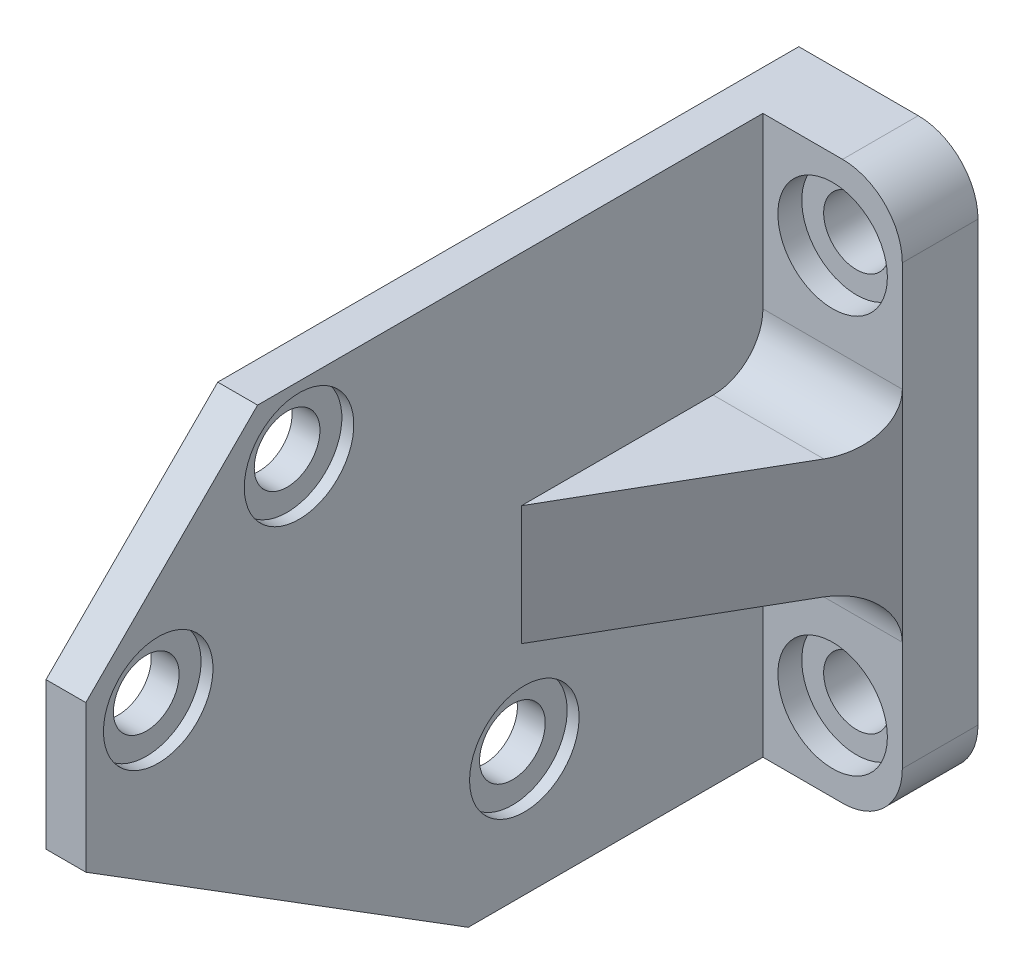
from build123d import *

# Parameters (mm, degrees)
SKETCH_1_W               = 9
SKETCH_1_H               = 28
EXTRUDE_1_DEPTH          = 34
CUT_EXTRUDE_START        = 3
SKETCH_2_W               = 7
SKETCH_2_H               = 28
CUT_EXTRUDE_1_DEPTH      = 41.370496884
SKETCH_3_R               = 1.65
CUT_EXTRUDE_2_DEPTH      = 38.429934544
SKETCH_4_R               = 2.75
CUT_EXTRUDE_3_DEPTH      = 0.6
CUT_EXTRUDE_4_DEPTH      = 38.429934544
SKETCH_6_R               = 1.65
CUT_EXTRUDE_5_DEPTH      = 42.060930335
SKETCH_7_R               = 2.75
CUT_EXTRUDE_6_DEPTH      = 1.2
CUT_EXTRUDE_7_DEPTH      = 38.429934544
CUT_EXTRUDE_7_DEPTH_BACK = 38.429934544
SKETCH_9_W               = 9
SKETCH_9_H               = 28
SKETCH_9_R               = 2.75
SKETCH_9_R_2             = 1.65
EXTRUDE_2_DEPTH          = 3.8
SKETCH_2_2_W             = 7
SKETCH_2_2_H             = 28
CUT_EXTRUDE_8_DEPTH      = 3.8
SKETCH_9_3_R             = 2.75
SKETCH_9_3_R_2           = 1.65
CUT_EXTRUDE_9_DEPTH      = 1.2
RIB_1_REACH              = 45.37
SKETCH_10_WALL_W         = 102.740993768
SKETCH_10_WALL_H         = 6
SKETCH_12_W              = 44.275745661
SKETCH_12_H              = 43.492919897
CUT_EXTRUDE_10_DEPTH     = 44.370496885
FILLET_1_R               = 3
FILLET_2_R               = 2.5
SKETCH_13_R              = 17.5
CUT_EXTRUDE_11_DEPTH     = 2


with BuildPart() as part:
    # Sketch 1 → Extrude 1 (new body)
    with BuildSketch(Plane.XY):
        with Locations((-18.5, 0)):
            Rectangle(SKETCH_1_W, SKETCH_1_H)
    extrude(amount=EXTRUDE_1_DEPTH)

    # Sketch 2 → Cut-Extrude 1 (cut, through all)
    with BuildSketch(Plane.XY.offset(CUT_EXTRUDE_START)):
        with Locations((-19.5, 0)):
            Rectangle(SKETCH_2_W, SKETCH_2_H)
    extrude(amount=CUT_EXTRUDE_1_DEPTH, mode=Mode.SUBTRACT)

    # Sketch 3 → Cut-Extrude 2 (cut, through all)
    with BuildSketch(Plane.ZY.offset(16)):
        with Locations((11.979898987, -7.644230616)):
            Circle(SKETCH_3_R)
        with Locations((23.293607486, 10.740545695)):
            Circle(SKETCH_3_R)
        with Locations((30.364675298, 3.669477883)):
            Circle(SKETCH_3_R)
    extrude(amount=-CUT_EXTRUDE_2_DEPTH, mode=Mode.SUBTRACT)

    # Sketch 4 → Cut-Extrude 3 (cut)
    with BuildSketch(Plane.ZY.offset(16)):
        with Locations((11.979898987, -7.644230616)):
            Circle(SKETCH_4_R)
        with Locations((23.293607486, 10.740545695)):
            Circle(SKETCH_4_R)
        with Locations((30.364675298, 3.669477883)):
            Circle(SKETCH_4_R)
    extrude(amount=-CUT_EXTRUDE_3_DEPTH, mode=Mode.SUBTRACT)

    # Sketch 5 → Cut-Extrude 4 (cut, through all)
    with BuildSketch(Plane.ZY.offset(16)):
        Polygon((34, 5.375870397), (25, 14.375870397), (34, 14.375870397), align=None)
    extrude(amount=-CUT_EXTRUDE_4_DEPTH, mode=Mode.SUBTRACT)

    # Sketch 6 → Cut-Extrude 5 (cut, through all)
    with BuildSketch(Plane.XY.offset(3)):
        with Locations((-19.5, 10)):
            Circle(SKETCH_6_R)
        with Locations((-19.5, -10)):
            Circle(SKETCH_6_R)
    extrude(amount=-CUT_EXTRUDE_5_DEPTH, mode=Mode.SUBTRACT)

    # Sketch 7 → Cut-Extrude 6 (cut)
    with BuildSketch(Plane.XY.offset(3)):
        with Locations((-19.5, 10)):
            Circle(SKETCH_7_R)
        with Locations((-19.5, -10)):
            Circle(SKETCH_7_R)
    extrude(amount=-CUT_EXTRUDE_6_DEPTH, mode=Mode.SUBTRACT)

    # Sketch 8 → Cut-Extrude 7 (cut, two sides: drawn at the far end of the back side and taken through both)
    with BuildSketch(Plane.ZY.offset(16).offset(-CUT_EXTRUDE_7_DEPTH_BACK)):
        Polygon((34, -2), (14.795985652, -14), (34, -14), align=None)
    extrude(amount=CUT_EXTRUDE_7_DEPTH + CUT_EXTRUDE_7_DEPTH_BACK, mode=Mode.SUBTRACT)

    # Sketch 9 → Extrude 2 (add)
    # profile 1 of 3: a face of its own
    with BuildSketch(Plane(origin=(0, 0, 0), x_dir=(-1, 0, 0), z_dir=(0, 0, -1))):
        with Locations((18.5, 0)):
            Rectangle(SKETCH_9_W, SKETCH_9_H)
        with Locations(Location((19.5, 10, 0), (0, 0, 180))):
            Circle(SKETCH_9_R, mode=Mode.SUBTRACT)
        with Locations(Location((19.5, -10, 0), (0, 0, 180))):
            Circle(SKETCH_9_R, mode=Mode.SUBTRACT)
    # profile 2 of 3: a face of its own
    with BuildSketch(Plane(origin=(0, 0, 0), x_dir=(-1, 0, 0), z_dir=(0, 0, -1))):
        with Locations(Location((19.5, 10, 0), (0, 0, 180))):
            Circle(SKETCH_9_R)
        with Locations(Location((19.5, 10, 0), (0, 0, 180))):
            Circle(SKETCH_9_R_2, mode=Mode.SUBTRACT)
    # profile 3 of 3: a face of its own
    with BuildSketch(Plane(origin=(0, 0, 0), x_dir=(-1, 0, 0), z_dir=(0, 0, -1))):
        with Locations(Location((19.5, -10, 0), (0, 0, 180))):
            Circle(SKETCH_9_R)
        with Locations(Location((19.5, -10, 0), (0, 0, 180))):
            Circle(SKETCH_9_R_2, mode=Mode.SUBTRACT)
    extrude(amount=EXTRUDE_2_DEPTH)

    # Sketch 2_2 → Cut-Extrude 8 (cut)
    with BuildSketch(Plane.XY):
        with Locations((-19.5, 0)):
            Rectangle(SKETCH_2_2_W, SKETCH_2_2_H)
    extrude(amount=CUT_EXTRUDE_8_DEPTH, mode=Mode.SUBTRACT)

    # Sketch 9_3 → Cut-Extrude 9 (cut)
    # profile 1 of 2: a face of its own
    with BuildSketch(Plane(origin=(0, 0, 0), x_dir=(-1, 0, 0), z_dir=(0, 0, -1))):
        with Locations((19.5, -10)):
            Circle(SKETCH_9_3_R)
        with Locations((19.5, -10)):
            Circle(SKETCH_9_3_R_2, mode=Mode.SUBTRACT)
    # profile 2 of 2: a face of its own
    with BuildSketch(Plane(origin=(0, 0, 0), x_dir=(-1, 0, 0), z_dir=(0, 0, -1))):
        with Locations((19.5, 10)):
            Circle(SKETCH_9_3_R)
    extrude(amount=CUT_EXTRUDE_9_DEPTH, mode=Mode.SUBTRACT)

    # Sketch 10 wall → Rib 1 (add, up to next)
    with BuildSketch(Plane(origin=(-19.5, 0, 6.062177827), x_dir=(-0.499999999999, 0, -0.866025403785), z_dir=(-0.866025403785, 0, 0.499999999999)), mode=Mode.PRIVATE) as rib_1_sk1:
        Rectangle(SKETCH_10_WALL_W, SKETCH_10_WALL_H)
    rib_1_tool1 = extrude(rib_1_sk1.sketch, amount=-RIB_1_REACH, mode=Mode.PRIVATE) - part.part
    add(rib_1_tool1.solids().sort_by_distance((-19.5, 0, 6.062177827))[0])


with BuildPart() as body_2:
    # Mirror 2: mirrored copy
    add(part.part.mirror(Plane(origin=(0, 0, 0), x_dir=(0, 0, 1), z_dir=(1, 0, 0))))

    # Fillet 1
    fillet_1_edges = [body_2.edges().sort_by_distance(p)[0] for p in [
        (23, -14, -1.9),
        (23, 14, -1.9),
    ]]
    fillet(fillet_1_edges, radius=FILLET_1_R)

    # Fillet 2
    fillet_2_edges = [body_2.edges().sort_by_distance(p)[0] for p in [
        (19.5, -3, 0),
        (19.5, 3, 0),
    ]]
    fillet(fillet_2_edges, radius=FILLET_2_R)

    # Sketch 13 → Cut-Extrude 11 (cut)
    with BuildSketch(Plane(origin=(0, 0, -3.8), x_dir=(-1, 0, 0), z_dir=(0, 0, -1))):
        Circle(SKETCH_13_R)
    extrude(amount=-CUT_EXTRUDE_11_DEPTH, mode=Mode.SUBTRACT)


with BuildPart() as part_1:
    add(part.part)

    # Sketch 12 → Cut-Extrude 10 (cut, through all)
    with BuildSketch(Plane(origin=(0, 0, 0), x_dir=(0, 0, -1), z_dir=(1, 0, 0))):
        with Locations((-14.63264787, -0.549499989)):
            Rectangle(SKETCH_12_W, SKETCH_12_H)
    extrude(amount=-CUT_EXTRUDE_10_DEPTH, mode=Mode.SUBTRACT)


solid = body_2.part
